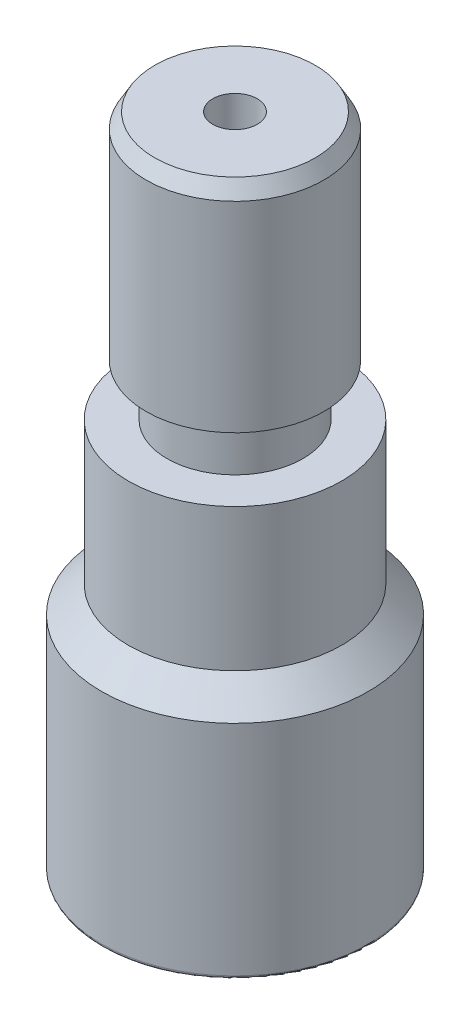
from build123d import *
from OCP.BRepFilletAPI import BRepFilletAPI_MakeChamfer

# Parameters (mm, degrees)
SKETCH1_R                      = 4.7625
EXTRUDE1_DEPTH                 = 8.89
SKETCH2_R                      = 3.81
EXTRUDE2_DEPTH                 = 5.08
SKETCH3_R                      = 2.4257
EXTRUDE3_DEPTH                 = 1.524
SKETCH4_R                      = 3.175
EXTRUDE4_DEPTH                 = 8.001
F_25_28_MIDDLE_D               = 5.4102
F_25_28_MIDDLE_DEPTH           = 5.8928
F_25_28_MIDDLE_CSINK_D         = 6.85799406
F_25_28_MIDDLE_CSINK_ANGLE     = 90
F_1_16_0_0625_DIAMETER_HOLE1_D = 1.5875
CHAMFER1_SIZE                  = 0.5334
CHAMFER1_SIZE2                 = 0.307958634
FILLET1_R                      = 0.127


with BuildPart() as part:
    # Sketch1 → Extrude1 (new body)
    with BuildSketch(Plane(origin=(0, 0, 0), x_dir=(1, 0, 0), z_dir=(0, 1, 0))):
        with Locations(Location((0, 0, 0), (0, 0, 270))):
            Circle(SKETCH1_R)
    extrude(amount=EXTRUDE1_DEPTH)

    # Sketch2 → Extrude2 (add)
    with BuildSketch(Plane(origin=(0, 8.89, 0), x_dir=(-1, 0, 0), z_dir=(0, 1, 0))):
        with Locations(Location((0, 0, 0), (0, 0, 90))):
            Circle(SKETCH2_R)
    extrude(amount=EXTRUDE2_DEPTH)

    # Sketch3 → Extrude3 (add)
    with BuildSketch(Plane(origin=(0, 13.97, 0), x_dir=(-1, 0, 0), z_dir=(0, 1, 0))):
        with Locations(Location((0, 0, 0), (0, 0, 270))):
            Circle(SKETCH3_R)
    extrude(amount=EXTRUDE3_DEPTH)

    # Sketch4 → Extrude4 (add)
    with BuildSketch(Plane(origin=(0, 15.494, 0), x_dir=(-1, 0, 0), z_dir=(0, 1, 0))):
        with Locations(Location((0, 0, 0), (0, 0, 90))):
            Circle(SKETCH4_R)
    extrude(amount=EXTRUDE4_DEPTH)

    # 25-28 middle
    with Locations(Plane(origin=(-13.893235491, 0, -66.486455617), x_dir=(1, 0, 0), z_dir=(0, -1, 0))):
        with Locations((13.893235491, 66.486455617)):
            CounterSinkHole(F_25_28_MIDDLE_D / 2, F_25_28_MIDDLE_CSINK_D / 2, depth=F_25_28_MIDDLE_DEPTH, counter_sink_angle=F_25_28_MIDDLE_CSINK_ANGLE)

    # 1_16 _0.0625_ Diameter Hole1 (through all)
    with Locations(Plane(origin=(0.027698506, 5.8928, 12.661925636), x_dir=(1, 0, 0), z_dir=(0, -1, 0))):
        with Locations((-0.027698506, -12.661925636)):
            Hole(F_1_16_0_0625_DIAMETER_HOLE1_D / 2)

    # Chamfer1: one chamfer whose edges measure the first distance from different faces: ONE call of the kernel's chamfer builder (chamfer() names one face for all edges)
    chamfer1_edges_1 = [part.edges().sort_by_distance(p)[0] for p in [
        (0, 15.494, -3.175),
    ]]
    chamfer1_side_1 = [part.faces().sort_by_distance(p)[0] for p in [
        (0, 15.494, -3.085197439),
    ]]
    chamfer1_edges_2 = [part.edges().sort_by_distance(p)[0] for p in [
        (0, 23.495, -3.175),
    ]]
    chamfer1_side_2 = [part.faces().sort_by_distance(p)[0] for p in [
        (0, 19.4945, -3.175),
    ]]
    chamfer1 = BRepFilletAPI_MakeChamfer(part.part.solid().wrapped)
    for e in chamfer1_edges_1:
        chamfer1.Add(CHAMFER1_SIZE, CHAMFER1_SIZE2, e.wrapped, chamfer1_side_1[0].wrapped)  # the first distance lies on this face
    for e in chamfer1_edges_2:
        chamfer1.Add(CHAMFER1_SIZE, CHAMFER1_SIZE2, e.wrapped, chamfer1_side_2[0].wrapped)  # the first distance lies on this face
    add(Compound.cast(chamfer1.Shape()), mode=Mode.REPLACE)

    # Fillet1
    fillet1_edges = [part.edges().sort_by_distance(p)[0] for p in [
        (0, 0, -4.7625),
    ]]
    fillet(fillet1_edges, radius=FILLET1_R)

    # Sketch26 → Cut-Revolve1 (revolve, cut)
    with BuildSketch(Plane.XY, mode=Mode.PRIVATE) as cut_revolve1_sk:
        Polygon((3.81, 8.89), (4.7625, 7.9375), (4.7625, 8.89), align=None)
    revolve(cut_revolve1_sk.sketch.rotate(Axis((0, 0, 0), (0, -1, 0)), 270), axis=Axis((0, 0, 0), (0, -1, 0)), mode=Mode.SUBTRACT)


solid = part.part
